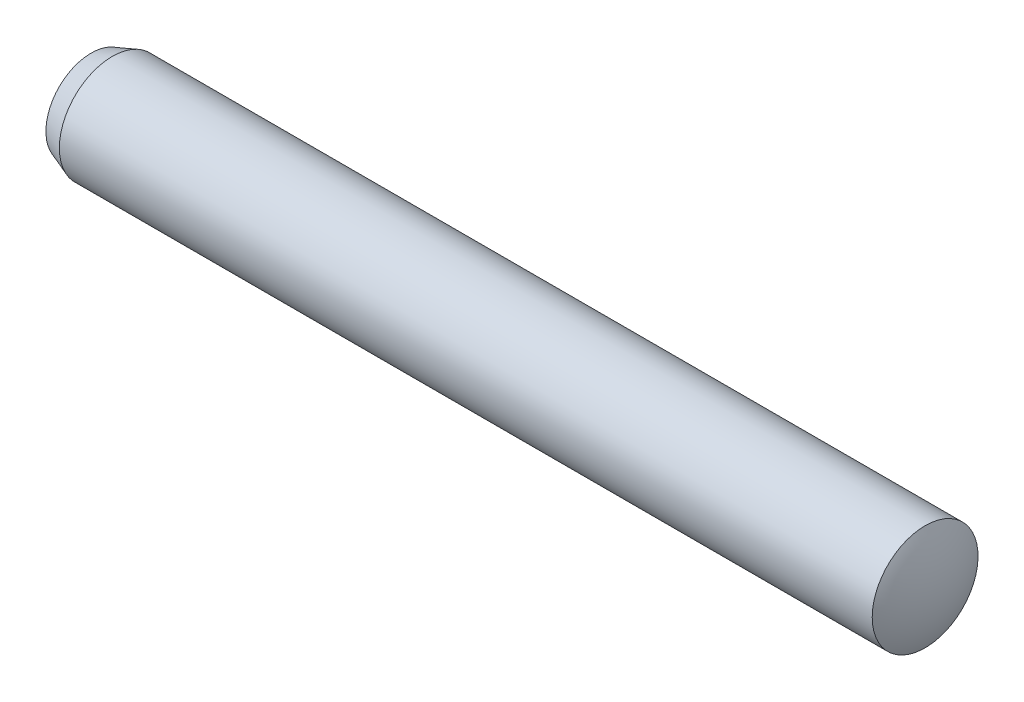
ISO-10303-21;
HEADER;
FILE_DESCRIPTION(('STEP AP214'),'2;1');
FILE_NAME('part.step','',(''),(''),'','','');
FILE_SCHEMA(('AUTOMOTIVE_DESIGN { 1 0 10303 214 1 1 1 1 }'));
ENDSEC;
DATA;
#1=APPLICATION_CONTEXT('core data for automotive mechanical design processes');
#2=APPLICATION_PROTOCOL_DEFINITION('international standard','automotive_design',2000,#1);
#3=PRODUCT_CONTEXT('',#1,'mechanical');
#4=PRODUCT('Part','Part','',(#3));
#5=PRODUCT_RELATED_PRODUCT_CATEGORY('part','',(#4));
#6=PRODUCT_DEFINITION_FORMATION('','',#4);
#7=PRODUCT_DEFINITION_CONTEXT('part definition',#1,'design');
#8=PRODUCT_DEFINITION('design','',#6,#7);
#9=PRODUCT_DEFINITION_SHAPE('','',#8);
#10=(LENGTH_UNIT() NAMED_UNIT(*) SI_UNIT(.MILLI.,.METRE.));
#11=(NAMED_UNIT(*) PLANE_ANGLE_UNIT() SI_UNIT($,.RADIAN.));
#12=(NAMED_UNIT(*) SI_UNIT($,.STERADIAN.) SOLID_ANGLE_UNIT());
#13=UNCERTAINTY_MEASURE_WITH_UNIT(LENGTH_MEASURE(1.E-05),#10,'distance_accuracy_value','');
#14=(GEOMETRIC_REPRESENTATION_CONTEXT(3) GLOBAL_UNCERTAINTY_ASSIGNED_CONTEXT((#13)) GLOBAL_UNIT_ASSIGNED_CONTEXT((#10,
#11,#12)) REPRESENTATION_CONTEXT('',''));
#15=CARTESIAN_POINT('',(0.,0.,0.));
#16=DIRECTION('',(0.,0.,1.));
#17=DIRECTION('',(1.,0.,0.));
#18=AXIS2_PLACEMENT_3D('',#15,#16,#17);
#19=CARTESIAN_POINT('',(0.,0.,0.));
#20=DIRECTION('',(-0.999999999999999,0.,0.));
#21=DIRECTION('',(0.,0.,1.));
#22=AXIS2_PLACEMENT_3D('',#19,#20,#21);
#23=PLANE('',#22);
#24=CARTESIAN_POINT('',(0.,0.,0.));
#25=DIRECTION('',(-0.999999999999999,0.,0.));
#26=DIRECTION('',(0.,0.,1.));
#27=AXIS2_PLACEMENT_3D('',#24,#25,#26);
#28=CIRCLE('',#27,4.27205953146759);
#29=CARTESIAN_POINT('',(0.,0.,-4.2720595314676));
#30=VERTEX_POINT('',#29);
#31=EDGE_CURVE('E10',#30,#30,#28,.T.);
#32=ORIENTED_EDGE('',*,*,#31,.T.);
#33=EDGE_LOOP('',(#32));
#34=FACE_BOUND('',#33,.T.);
#35=ADVANCED_FACE('F27',(#34),#23,.T.);
#36=CARTESIAN_POINT('',(0.,0.,0.));
#37=DIRECTION('',(0.999999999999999,0.,0.));
#38=DIRECTION('',(0.,0.,-1.));
#39=AXIS2_PLACEMENT_3D('',#36,#37,#38);
#40=CONICAL_SURFACE('',#39,4.27205953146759,0.349065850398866);
#41=CARTESIAN_POINT('',(2.,0.,0.));
#42=DIRECTION('',(-0.999999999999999,0.,0.));
#43=DIRECTION('',(0.,0.,1.));
#44=AXIS2_PLACEMENT_3D('',#41,#42,#43);
#45=CIRCLE('',#44,5.);
#46=CARTESIAN_POINT('',(1.99999999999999,0.,-5.));
#47=VERTEX_POINT('',#46);
#48=EDGE_CURVE('E33',#47,#47,#45,.T.);
#49=CARTESIAN_POINT('',(1.99999999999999,0.,-5.));
#50=CARTESIAN_POINT('',(1.97916666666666,0.,-4.99241728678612));
#51=CARTESIAN_POINT('',(1.95833333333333,0.,-4.98483457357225));
#52=CARTESIAN_POINT('',(1.91666666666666,0.,-4.96966914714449));
#53=CARTESIAN_POINT('',(1.89583333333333,0.,-4.96208643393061));
#54=CARTESIAN_POINT('',(1.85416666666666,0.,-4.94692100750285));
#55=CARTESIAN_POINT('',(1.83333333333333,0.,-4.93933829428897));
#56=CARTESIAN_POINT('',(1.79166666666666,0.,-4.92417286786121));
#57=CARTESIAN_POINT('',(1.77083333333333,0.,-4.91659015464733));
#58=CARTESIAN_POINT('',(1.72916666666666,0.,-4.90142472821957));
#59=CARTESIAN_POINT('',(1.70833333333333,0.,-4.89384201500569));
#60=CARTESIAN_POINT('',(1.66666666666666,0.,-4.87867658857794));
#61=CARTESIAN_POINT('',(1.64583333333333,0.,-4.87109387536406));
#62=CARTESIAN_POINT('',(1.60416666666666,0.,-4.8559284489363));
#63=CARTESIAN_POINT('',(1.58333333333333,0.,-4.84834573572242));
#64=CARTESIAN_POINT('',(1.54166666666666,0.,-4.83318030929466));
#65=CARTESIAN_POINT('',(1.52083333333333,0.,-4.82559759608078));
#66=CARTESIAN_POINT('',(1.47916666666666,0.,-4.81043216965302));
#67=CARTESIAN_POINT('',(1.45833333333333,0.,-4.80284945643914));
#68=CARTESIAN_POINT('',(1.41666666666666,0.,-4.78768403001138));
#69=CARTESIAN_POINT('',(1.39583333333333,0.,-4.78010131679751));
#70=CARTESIAN_POINT('',(1.35416666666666,0.,-4.76493589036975));
#71=CARTESIAN_POINT('',(1.33333333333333,0.,-4.75735317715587));
#72=CARTESIAN_POINT('',(1.29166666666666,0.,-4.74218775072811));
#73=CARTESIAN_POINT('',(1.27083333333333,0.,-4.73460503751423));
#74=CARTESIAN_POINT('',(1.22916666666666,0.,-4.71943961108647));
#75=CARTESIAN_POINT('',(1.20833333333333,0.,-4.71185689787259));
#76=CARTESIAN_POINT('',(1.16666666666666,0.,-4.69669147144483));
#77=CARTESIAN_POINT('',(1.14583333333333,0.,-4.68910875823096));
#78=CARTESIAN_POINT('',(1.10416666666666,0.,-4.6739433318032));
#79=CARTESIAN_POINT('',(1.08333333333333,0.,-4.66636061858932));
#80=CARTESIAN_POINT('',(1.04166666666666,0.,-4.65119519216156));
#81=CARTESIAN_POINT('',(1.02083333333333,0.,-4.64361247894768));
#82=CARTESIAN_POINT('',(0.979166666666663,0.,-4.62844705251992));
#83=CARTESIAN_POINT('',(0.958333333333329,0.,-4.62086433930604));
#84=CARTESIAN_POINT('',(0.916666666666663,0.,-4.60569891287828));
#85=CARTESIAN_POINT('',(0.89583333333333,0.,-4.59811619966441));
#86=CARTESIAN_POINT('',(0.854166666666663,0.,-4.58295077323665));
#87=CARTESIAN_POINT('',(0.83333333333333,0.,-4.57536806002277));
#88=CARTESIAN_POINT('',(0.791666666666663,0.,-4.56020263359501));
#89=CARTESIAN_POINT('',(0.77083333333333,0.,-4.55261992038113));
#90=CARTESIAN_POINT('',(0.729166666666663,0.,-4.53745449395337));
#91=CARTESIAN_POINT('',(0.70833333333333,0.,-4.52987178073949));
#92=CARTESIAN_POINT('',(0.666666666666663,0.,-4.51470635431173));
#93=CARTESIAN_POINT('',(0.64583333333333,0.,-4.50712364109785));
#94=CARTESIAN_POINT('',(0.604166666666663,0.,-4.49195821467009));
#95=CARTESIAN_POINT('',(0.58333333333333,0.,-4.48437550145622));
#96=CARTESIAN_POINT('',(0.541666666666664,0.,-4.46921007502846));
#97=CARTESIAN_POINT('',(0.52083333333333,0.,-4.46162736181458));
#98=CARTESIAN_POINT('',(0.479166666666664,0.,-4.44646193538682));
#99=CARTESIAN_POINT('',(0.45833333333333,0.,-4.43887922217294));
#100=CARTESIAN_POINT('',(0.416666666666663,0.,-4.42371379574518));
#101=CARTESIAN_POINT('',(0.39583333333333,0.,-4.4161310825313));
#102=CARTESIAN_POINT('',(0.354166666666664,0.,-4.40096565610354));
#103=CARTESIAN_POINT('',(0.33333333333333,0.,-4.39338294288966));
#104=CARTESIAN_POINT('',(0.291666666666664,0.,-4.37821751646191));
#105=CARTESIAN_POINT('',(0.27083333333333,0.,-4.37063480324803));
#106=CARTESIAN_POINT('',(0.229166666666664,0.,-4.35546937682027));
#107=CARTESIAN_POINT('',(0.208333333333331,0.,-4.34788666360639));
#108=CARTESIAN_POINT('',(0.166666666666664,0.,-4.33272123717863));
#109=CARTESIAN_POINT('',(0.145833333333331,0.,-4.32513852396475));
#110=CARTESIAN_POINT('',(0.104166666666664,0.,-4.30997309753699));
#111=CARTESIAN_POINT('',(0.0833333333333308,0.,-4.30239038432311));
#112=CARTESIAN_POINT('',(0.0416666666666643,0.,-4.28722495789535));
#113=CARTESIAN_POINT('',(0.020833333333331,0.,-4.27964224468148));
#114=CARTESIAN_POINT('',(0.,0.,-4.2720595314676));
#115=B_SPLINE_CURVE_WITH_KNOTS('',3,(#49,#50,#51,#52,#53,#54,#55,#56,#57,#58,#59,#60,#61,#62,
#63,#64,#65,#66,#67,#68,#69,#70,#71,#72,#73,#74,#75,#76,#77,#78,#79,#80,#81,#82,#83,#84,#85,#86,
#87,#88,#89,#90,#91,#92,#93,#94,#95,#96,#97,#98,#99,#100,#101,#102,#103,#104,#105,#106,#107,
#108,#109,#110,#111,#112,#113,#114),.UNSPECIFIED.,.F.,.F.,(4,2,2,2,2,2,2,2,2,2,2,2,2,2,2,2,2,2,
2,2,2,2,2,2,2,2,2,2,2,2,2,2,4),(0.,0.0665111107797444,0.133022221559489,0.199533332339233,
0.266044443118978,0.332555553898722,0.399066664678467,0.465577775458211,0.532088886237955,
0.5985999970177,0.665111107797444,0.731622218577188,0.798133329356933,0.864644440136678,
0.931155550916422,0.997666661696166,1.06417777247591,1.13068888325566,1.1971999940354,
1.26371110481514,1.33022221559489,1.39673332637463,1.46324443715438,1.52975554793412,
1.59626665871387,1.66277776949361,1.72928888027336,1.7957999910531,1.86231110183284,
1.92882221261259,1.99533332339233,2.06184443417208,2.12835554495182),.UNSPECIFIED.);
#116=EDGE_CURVE('BSEAM53',#47,#30,#115,.T.);
#117=ORIENTED_EDGE('',*,*,#48,.T.);
#118=ORIENTED_EDGE('',*,*,#31,.F.);
#119=ORIENTED_EDGE('',*,*,#116,.T.);
#120=ORIENTED_EDGE('',*,*,#116,.F.);
#121=EDGE_LOOP('',(#117,#119,#118,#120));
#122=FACE_BOUND('',#121,.T.);
#123=ADVANCED_FACE('F53',(#122),#40,.T.);
#124=CARTESIAN_POINT('',(0.,0.,0.));
#125=DIRECTION('',(-0.999999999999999,0.,0.));
#126=DIRECTION('',(0.,0.,1.));
#127=AXIS2_PLACEMENT_3D('',#124,#125,#126);
#128=CYLINDRICAL_SURFACE('',#127,5.);
#129=CARTESIAN_POINT('',(78.7999999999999,0.,0.));
#130=DIRECTION('',(-0.999999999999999,0.,0.));
#131=DIRECTION('',(0.,0.,1.));
#132=AXIS2_PLACEMENT_3D('',#129,#130,#131);
#133=CIRCLE('',#132,5.);
#134=CARTESIAN_POINT('',(78.7999999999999,0.,5.));
#135=VERTEX_POINT('',#134);
#136=EDGE_CURVE('E37',#135,#135,#133,.T.);
#137=ORIENTED_EDGE('',*,*,#136,.T.);
#138=EDGE_LOOP('',(#137));
#139=FACE_BOUND('',#138,.T.);
#140=ORIENTED_EDGE('',*,*,#48,.F.);
#141=EDGE_LOOP('',(#140));
#142=FACE_BOUND('',#141,.T.);
#143=ADVANCED_FACE('F44',(#139,#142),#128,.T.);
#144=CARTESIAN_POINT('',(68.9833333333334,0.,0.));
#145=DIRECTION('',(-0.999999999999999,0.,0.));
#146=DIRECTION('',(0.,1.,0.));
#147=AXIS2_PLACEMENT_3D('',#144,#145,#146);
#148=SPHERICAL_SURFACE('',#147,11.0166666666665);
#149=ORIENTED_EDGE('',*,*,#136,.F.);
#150=EDGE_LOOP('',(#149));
#151=FACE_BOUND('',#150,.T.);
#152=ADVANCED_FACE('F47',(#151),#148,.T.);
#153=CLOSED_SHELL('',(#35,#123,#143,#152));
#154=MANIFOLD_SOLID_BREP('B2',#153);
#155=ADVANCED_BREP_SHAPE_REPRESENTATION('',(#18,#154),#14);
#156=SHAPE_DEFINITION_REPRESENTATION(#9,#155);
ENDSEC;
END-ISO-10303-21;
